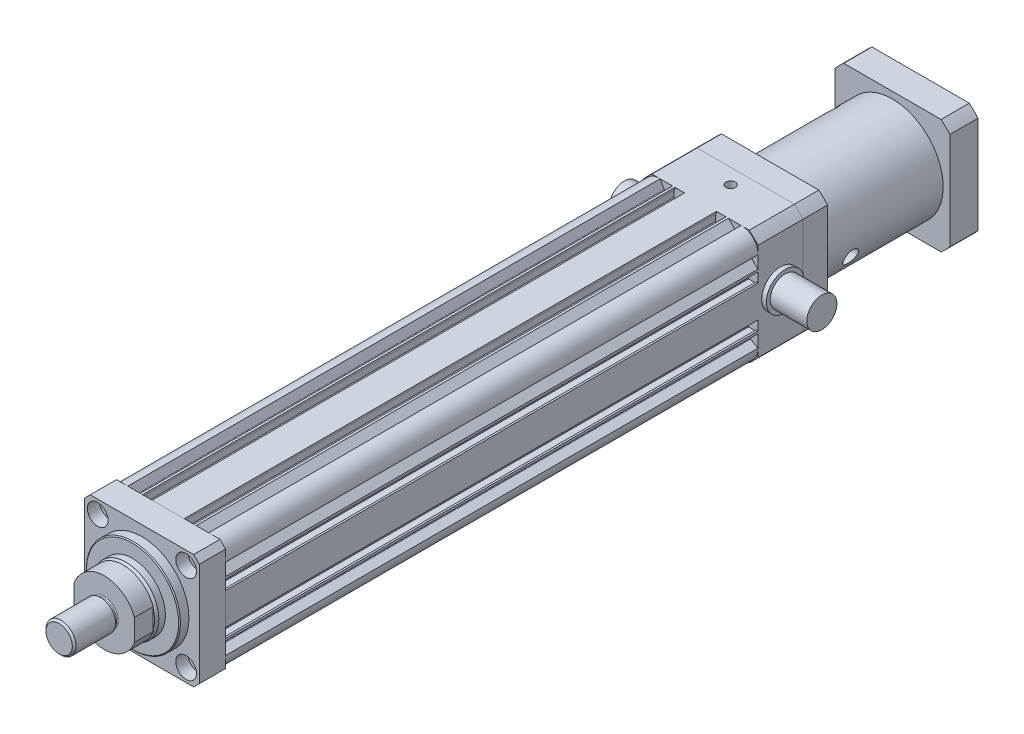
from build123d import *

# Parameters (mm, degrees)
SKETCH_1_R           = 25
SKETCH_1_R_2         = 2.594
EXTRUDE_1_DEPTH      = 283
EXTRUDE_1_2_DEPTH    = 14
SKETCH_3_R           = 4.5
SKETCH_3_R_2         = 3.5
CUT_EXTRUDE_3_DEPTH  = 14
SKETCH_3_5_R         = 5.5
CUT_EXTRUDE_4_DEPTH  = 6.5
SKETCH_5_R           = 25
EXTRUDE_2_DEPTH      = 5
CHAMFER_1_SIZE       = 0.5
SKETCH_6_R           = 17.5
EXTRUDE_3_DEPTH      = 5
CHAMFER_2_SIZE       = 1.5
CHAMFER_2_SIZE2      = 0.8
EXTRUDE_4_DEPTH      = 10
SKETCH_8_R           = 7
EXTRUDE_5_DEPTH      = 2
SKETCH_9_R           = 8
EXTRUDE_6_DEPTH      = 22
CHAMFER_3_SIZE       = 1
FILLET_1_R           = 0.5
SKETCH_10_W          = 61
SKETCH_10_H          = 61
EXTRUDE_7_DEPTH      = 24
SKETCH_11_R          = 50
SKETCH_11_R_2        = 40
CUT_EXTRUDE_1_DEPTH  = 24
SKETCH_16_W          = 61
SKETCH_16_H          = 61
EXTRUDE_8_DEPTH      = 13
SKETCH_18_R          = 3.5
CUT_EXTRUDE_5_DEPTH  = 13
SKETCH_19_R          = 27
EXTRUDE_9_DEPTH      = 65
SKETCH_20_W          = 61
SKETCH_20_H          = 61
EXTRUDE_10_DEPTH     = 15
SKETCH_21_R          = 2.5
CUT_EXTRUDE_6_DEPTH  = 10
SKETCH_22_R          = 50
SKETCH_22_R_2        = 40
CUT_EXTRUDE_2_DEPTH  = 93
SKETCH_23_R          = 21
CUT_EXTRUDE_7_DEPTH  = 80
SKETCH_23_3_R        = 25
CUT_EXTRUDE_8_DEPTH  = 7
SKETCH_24_R          = 4
CUT_EXTRUDE_9_DEPTH  = 27
SKETCH_25_R          = 4
CUT_EXTRUDE_10_DEPTH = 27
SKETCH_26_R          = 8
EXTRUDE_11_DEPTH     = 22
EXTRUDE_START        = -83
SKETCH_26_2_R        = 8
EXTRUDE_12_DEPTH     = 22
SKETCH_27_R          = 10
SKETCH_27_R_2        = 8
EXTRUDE_13_DEPTH     = 2.5
EXTRUDE_START_2      = -63.5
SKETCH_27_2_R        = 10
SKETCH_27_2_R_2      = 8
EXTRUDE_14_DEPTH     = 2.5


with BuildPart() as part:
    # Sketch 1 → Extrude 1 (new body)
    with BuildSketch(Plane.XY):
        with BuildLine():
            Line((30.5, 8.5), (29.5, 8.5))
            Line((29.5, 8.5), (29.5, 7.9))
            Line((29.5, 7.9), (25.5, 7.9))
            Line((25.5, 7.9), (25.5, 14.2))
            Line((25.5, 14.2), (29.5, 14.2))
            Line((29.5, 14.2), (29.5, 13.6))
            Line((29.5, 13.6), (30.5, 13.6))
            Line((30.5, 13.6), (30.5, 14.843551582))
            Line((30.5, 14.843551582), (26.602512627, 18.741038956))
            ThreePointArc((26.602512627, 18.741038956), (26.502994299, 19.034210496), (26.675, 19.29163522))
            Line((26.675, 19.29163522), (30.5, 21.5))
            ThreePointArc((30.5, 21.5), (28.010599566, 28.010599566), (21.5, 30.5))
            Line((21.5, 30.5), (19.29163522, 26.675))
            ThreePointArc((19.29163522, 26.675), (19.034210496, 26.502994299), (18.741038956, 26.602512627))
            Line((18.741038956, 26.602512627), (14.843551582, 30.5))
            Line((14.843551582, 30.5), (13.6, 30.5))
            Line((13.6, 30.5), (13.6, 29.5))
            Line((13.6, 29.5), (14.2, 29.5))
            Line((14.2, 29.5), (14.2, 25.5))
            Line((14.2, 25.5), (7.9, 25.5))
            Line((7.9, 25.5), (7.9, 29.5))
            Line((7.9, 29.5), (8.5, 29.5))
            Line((8.5, 29.5), (8.5, 30.5))
            Line((8.5, 30.5), (-8.5, 30.5))
            Line((-8.5, 30.5), (-8.5, 29.5))
            Line((-8.5, 29.5), (-7.9, 29.5))
            Line((-7.9, 29.5), (-7.9, 25.5))
            Line((-7.9, 25.5), (-14.2, 25.5))
            Line((-14.2, 25.5), (-14.2, 29.5))
            Line((-14.2, 29.5), (-13.6, 29.5))
            Line((-13.6, 29.5), (-13.6, 30.5))
            Line((-13.6, 30.5), (-14.843551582, 30.5))
            Line((-14.843551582, 30.5), (-18.741038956, 26.602512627))
            ThreePointArc((-18.741038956, 26.602512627), (-19.034210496, 26.502994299), (-19.29163522, 26.675))
            Line((-19.29163522, 26.675), (-21.5, 30.5))
            ThreePointArc((-21.5, 30.5), (-28.010599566, 28.010599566), (-30.5, 21.5))
            Line((-30.5, 21.5), (-26.675, 19.29163522))
            ThreePointArc((-26.675, 19.29163522), (-26.502994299, 19.034210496), (-26.602512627, 18.741038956))
            Line((-26.602512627, 18.741038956), (-30.5, 14.843551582))
            Line((-30.5, 14.843551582), (-30.5, 13.6))
            Line((-30.5, 13.6), (-29.5, 13.6))
            Line((-29.5, 13.6), (-29.5, 14.2))
            Line((-29.5, 14.2), (-25.5, 14.2))
            Line((-25.5, 14.2), (-25.5, 7.9))
            Line((-25.5, 7.9), (-29.5, 7.9))
            Line((-29.5, 7.9), (-29.5, 8.5))
            Line((-29.5, 8.5), (-30.5, 8.5))
            Line((-30.5, 8.5), (-30.5, -8.5))
            Line((-30.5, -8.5), (-29.5, -8.5))
            Line((-29.5, -8.5), (-29.5, -7.9))
            Line((-29.5, -7.9), (-25.5, -7.9))
            Line((-25.5, -7.9), (-25.5, -14.2))
            Line((-25.5, -14.2), (-29.5, -14.2))
            Line((-29.5, -14.2), (-29.5, -13.6))
            Line((-29.5, -13.6), (-30.5, -13.6))
            Line((-30.5, -13.6), (-30.5, -14.843551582))
            Line((-30.5, -14.843551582), (-26.602512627, -18.741038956))
            ThreePointArc((-26.602512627, -18.741038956), (-26.502994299, -19.034210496), (-26.675, -19.29163522))
            Line((-26.675, -19.29163522), (-30.5, -21.5))
            ThreePointArc((-30.5, -21.5), (-27.825897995, -28.191225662), (-21, -30.5))
            Line((-21, -30.5), (-18.79163522, -26.675))
            ThreePointArc((-18.79163522, -26.675), (-18.534210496, -26.502994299), (-18.241038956, -26.602512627))
            Line((-18.241038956, -26.602512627), (-14.343551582, -30.5))
            Line((-14.343551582, -30.5), (14.343551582, -30.5))
            Line((14.343551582, -30.5), (18.241038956, -26.602512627))
            ThreePointArc((18.241038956, -26.602512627), (18.534210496, -26.502994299), (18.79163522, -26.675))
            Line((18.79163522, -26.675), (21, -30.5))
            ThreePointArc((21, -30.5), (27.825897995, -28.191225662), (30.5, -21.5))
            Line((30.5, -21.5), (26.675, -19.29163522))
            ThreePointArc((26.675, -19.29163522), (26.502994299, -19.034210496), (26.602512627, -18.741038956))
            Line((26.602512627, -18.741038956), (30.5, -14.843551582))
            Line((30.5, -14.843551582), (30.5, -13.6))
            Line((30.5, -13.6), (29.5, -13.6))
            Line((29.5, -13.6), (29.5, -14.2))
            Line((29.5, -14.2), (25.5, -14.2))
            Line((25.5, -14.2), (25.5, -7.9))
            Line((25.5, -7.9), (29.5, -7.9))
            Line((29.5, -7.9), (29.5, -8.5))
            Line((29.5, -8.5), (30.5, -8.5))
            Line((30.5, -8.5), (30.5, 8.5))
        make_face()
        Circle(SKETCH_1_R, mode=Mode.SUBTRACT)
        with Locations((23.5, -23.5)):
            Circle(SKETCH_1_R_2, mode=Mode.SUBTRACT)
        with Locations((-23.5, -23.5)):
            Circle(SKETCH_1_R_2, mode=Mode.SUBTRACT)
        with Locations((23.5, 23.5)):
            Circle(SKETCH_1_R_2, mode=Mode.SUBTRACT)
        with Locations((-23.5, 23.5)):
            Circle(SKETCH_1_R_2, mode=Mode.SUBTRACT)
        with BuildLine():
            Line((-14.843484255, -26.551505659), (-5.699422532, -26.551505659))
            ThreePointArc((-5.699422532, -26.551505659), (-5.401016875, -26.282393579), (-5.637974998, -25.957866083))
            ThreePointArc((-5.637974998, -25.957866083), (-10.496775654, -24.470016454), (-15.006657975, -22.128520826))
            ThreePointArc((-15.006657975, -22.128520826), (-15.31244973, -22.117932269), (-15.468484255, -22.381131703))
            Line((-15.468484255, -22.381131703), (-15.468484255, -25.926505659))
            Line((-15.468484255, -25.926505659), (-14.843484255, -26.551505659))
        make_face(mode=Mode.SUBTRACT)
        with BuildLine():
            Line((15.037740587, -26.551505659), (5.893678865, -26.551505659))
            ThreePointArc((5.893678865, -26.551505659), (5.595273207, -26.282393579), (5.832231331, -25.957866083))
            ThreePointArc((5.832231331, -25.957866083), (10.691031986, -24.470016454), (15.200914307, -22.128520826))
            ThreePointArc((15.200914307, -22.128520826), (15.506706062, -22.117932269), (15.662740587, -22.381131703))
            Line((15.662740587, -22.381131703), (15.662740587, -25.926505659))
            Line((15.662740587, -25.926505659), (15.037740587, -26.551505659))
        make_face(mode=Mode.SUBTRACT)
        with BuildLine():
            Line((24.057261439, -13.884764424), (23.358946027, -13.481591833))
            ThreePointArc((23.358946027, -13.481591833), (23.055418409, -13.441631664), (22.812535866, -13.628001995))
            Line((22.812535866, -13.628001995), (21.480305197, -15.935493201))
            ThreePointArc((21.480305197, -15.935493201), (21.440345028, -16.239020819), (21.626715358, -16.481903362))
            Line((21.626715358, -16.481903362), (22.892186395, -17.212523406))
            ThreePointArc((22.892186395, -17.212523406), (23.195714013, -17.252483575), (23.438596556, -17.066113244))
            Line((23.438596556, -17.066113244), (24.274264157, -15.618694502))
            ThreePointArc((24.274264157, -15.618694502), (24.317966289, -15.507082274), (24.326638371, -15.387533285))
            Line((24.326638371, -15.387533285), (24.223757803, -14.070923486))
            ThreePointArc((24.223757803, -14.070923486), (24.155411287, -13.964516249), (24.057261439, -13.884764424))
        make_face(mode=Mode.SUBTRACT)
        with BuildLine():
            Line((-24.057261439, -13.884764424), (-23.358946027, -13.481591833))
            ThreePointArc((-23.358946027, -13.481591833), (-23.055418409, -13.441631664), (-22.812535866, -13.628001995))
            Line((-22.812535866, -13.628001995), (-21.480305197, -15.935493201))
            ThreePointArc((-21.480305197, -15.935493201), (-21.440345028, -16.239020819), (-21.626715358, -16.481903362))
            Line((-21.626715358, -16.481903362), (-22.892186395, -17.212523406))
            ThreePointArc((-22.892186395, -17.212523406), (-23.195714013, -17.252483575), (-23.438596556, -17.066113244))
            Line((-23.438596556, -17.066113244), (-24.274264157, -15.618694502))
            ThreePointArc((-24.274264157, -15.618694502), (-24.317966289, -15.507082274), (-24.326638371, -15.387533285))
            Line((-24.326638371, -15.387533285), (-24.223757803, -14.070923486))
            ThreePointArc((-24.223757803, -14.070923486), (-24.155411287, -13.964516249), (-24.057261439, -13.884764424))
        make_face(mode=Mode.SUBTRACT)
        with BuildLine():
            Line((24.057261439, 13.884764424), (23.358946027, 13.481591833))
            ThreePointArc((23.358946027, 13.481591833), (23.055418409, 13.441631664), (22.812535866, 13.628001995))
            Line((22.812535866, 13.628001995), (21.480305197, 15.935493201))
            ThreePointArc((21.480305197, 15.935493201), (21.440345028, 16.239020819), (21.626715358, 16.481903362))
            Line((21.626715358, 16.481903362), (22.892186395, 17.212523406))
            ThreePointArc((22.892186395, 17.212523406), (23.195714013, 17.252483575), (23.438596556, 17.066113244))
            Line((23.438596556, 17.066113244), (24.274264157, 15.618694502))
            ThreePointArc((24.274264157, 15.618694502), (24.317966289, 15.507082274), (24.326638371, 15.387533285))
            Line((24.326638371, 15.387533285), (24.223757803, 14.070923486))
            ThreePointArc((24.223757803, 14.070923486), (24.155411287, 13.964516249), (24.057261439, 13.884764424))
        make_face(mode=Mode.SUBTRACT)
        with BuildLine():
            Line((-24.057261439, 13.884764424), (-23.358946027, 13.481591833))
            ThreePointArc((-23.358946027, 13.481591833), (-23.055418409, 13.441631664), (-22.812535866, 13.628001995))
            Line((-22.812535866, 13.628001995), (-21.480305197, 15.935493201))
            ThreePointArc((-21.480305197, 15.935493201), (-21.440345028, 16.239020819), (-21.626715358, 16.481903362))
            Line((-21.626715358, 16.481903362), (-22.892186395, 17.212523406))
            ThreePointArc((-22.892186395, 17.212523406), (-23.195714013, 17.252483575), (-23.438596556, 17.066113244))
            Line((-23.438596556, 17.066113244), (-24.274264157, 15.618694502))
            ThreePointArc((-24.274264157, 15.618694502), (-24.317966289, 15.507082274), (-24.326638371, 15.387533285))
            Line((-24.326638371, 15.387533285), (-24.223757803, 14.070923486))
            ThreePointArc((-24.223757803, 14.070923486), (-24.155411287, 13.964516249), (-24.057261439, 13.884764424))
        make_face(mode=Mode.SUBTRACT)
        with BuildLine():
            Line((17.761634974, 23.75411276), (17.07315308, 24.68624059))
            ThreePointArc((17.07315308, 24.68624059), (16.934629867, 24.812286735), (16.758415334, 24.87572765))
            Line((16.758415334, 24.87572765), (13.966108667, 25.295529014))
            ThreePointArc((13.966108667, 25.295529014), (13.689318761, 25.25468305), (13.482325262, 25.066441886))
            Line((13.482325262, 25.066441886), (12.839111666, 23.986237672))
            ThreePointArc((12.839111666, 23.986237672), (12.785382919, 23.626185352), (12.999780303, 23.331977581))
            ThreePointArc((12.999780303, 23.331977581), (14.833000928, 22.112125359), (16.576342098, 20.766949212))
            ThreePointArc((16.576342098, 20.766949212), (17.053890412, 20.688035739), (17.357364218, 21.065107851))
            Line((17.357364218, 21.065107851), (17.761634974, 23.75411276))
        make_face(mode=Mode.SUBTRACT)
        with BuildLine():
            Line((-17.761634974, 23.75411276), (-17.07315308, 24.68624059))
            ThreePointArc((-17.07315308, 24.68624059), (-16.934629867, 24.812286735), (-16.758415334, 24.87572765))
            Line((-16.758415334, 24.87572765), (-13.966108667, 25.295529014))
            ThreePointArc((-13.966108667, 25.295529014), (-13.689318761, 25.25468305), (-13.482325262, 25.066441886))
            Line((-13.482325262, 25.066441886), (-12.839111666, 23.986237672))
            ThreePointArc((-12.839111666, 23.986237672), (-12.785382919, 23.626185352), (-12.999780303, 23.331977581))
            ThreePointArc((-12.999780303, 23.331977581), (-14.833000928, 22.112125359), (-16.576342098, 20.766949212))
            ThreePointArc((-16.576342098, 20.766949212), (-17.053890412, 20.688035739), (-17.357364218, 21.065107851))
            Line((-17.357364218, 21.065107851), (-17.761634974, 23.75411276))
        make_face(mode=Mode.SUBTRACT)
    extrude(amount=EXTRUDE_1_DEPTH)

    # Sketch 10 → Extrude 7 (add)
    with BuildSketch(Plane(origin=(0, 0, 0), x_dir=(-1, 0, 0), z_dir=(0, 0, -1))):
        Rectangle(SKETCH_10_W, SKETCH_10_H)
    extrude(amount=EXTRUDE_7_DEPTH)

    # Sketch 11 → Cut-Extrude 1 (cut)
    with BuildSketch(Plane(origin=(0, 0, -24), x_dir=(-1, 0, 0), z_dir=(0, 0, -1))):
        Circle(SKETCH_11_R)
        Circle(SKETCH_11_R_2, mode=Mode.SUBTRACT)
    extrude(amount=-CUT_EXTRUDE_1_DEPTH, mode=Mode.SUBTRACT)

    # Sketch 15 → Hole Wizard M6 _1 (revolve, cut)
    with BuildSketch(Plane(origin=(0, 30.5, -16), x_dir=(0, 0, 1), z_dir=(1, 0, 0))):
        Polygon((0, 0), (0, 9.502151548), (2.5, 8), (2.5, 0), align=None)
    revolve(axis=Axis((0, 36.85, -16), (0, -1, 0)), mode=Mode.SUBTRACT)

    # Sketch 26 → Extrude 11 (add)
    with BuildSketch(Plane.ZY.offset(30.5)):
        with Locations((-12, 0)):
            Circle(SKETCH_26_R)
    extrude(amount=EXTRUDE_11_DEPTH)

    # Sketch 26_2 → Extrude 12 (add)
    with BuildSketch(Plane.ZY.offset(30.5).offset(EXTRUDE_START)):
        with Locations((-12, 0)):
            Circle(SKETCH_26_2_R)
    extrude(amount=EXTRUDE_12_DEPTH)

    # Sketch 27 → Extrude 13 (add)
    with BuildSketch(Plane.ZY.offset(30.5)):
        with Locations((-12, 0)):
            Circle(SKETCH_27_R)
        with Locations((-12, 0)):
            Circle(SKETCH_27_R_2, mode=Mode.SUBTRACT)
    extrude(amount=EXTRUDE_13_DEPTH)

    # Sketch 27_2 → Extrude 14 (add)
    with BuildSketch(Plane.ZY.offset(30.5).offset(EXTRUDE_START_2)):
        with Locations((-12, 0)):
            Circle(SKETCH_27_2_R)
        with Locations((-12, 0)):
            Circle(SKETCH_27_2_R_2, mode=Mode.SUBTRACT)
    extrude(amount=EXTRUDE_14_DEPTH)


with BuildPart() as body_2:
    # Sketch 2 → Extrude 1 2 (new body)
    with BuildSketch(Plane.XY.offset(283)):
        Polygon((-27.5, 30.5), (-30.5, 27.5), (-30.5, -27.5), (-27.5, -30.5), (27.5, -30.5), (30.5, -27.5), (30.5, 27.5), (27.5, 30.5), align=None)
    extrude(amount=EXTRUDE_1_2_DEPTH)

    # Sketch 3 → Cut-Extrude 3 (cut)
    with BuildSketch(Plane.XY.offset(297)):
        with Locations((-40, -20)):
            Circle(SKETCH_3_R)
        with Locations((-23.5, -23.5)):
            Circle(SKETCH_3_R_2)
        with Locations((-23.5, 23.5)):
            Circle(SKETCH_3_R_2)
        with Locations((23.5, 23.5)):
            Circle(SKETCH_3_R_2)
        with Locations((40, 20)):
            Circle(SKETCH_3_R)
        with Locations((40, -20)):
            Circle(SKETCH_3_R)
        with Locations((23.5, -23.5)):
            Circle(SKETCH_3_R_2)
        with Locations((-40, 20)):
            Circle(SKETCH_3_R)
    extrude(amount=-CUT_EXTRUDE_3_DEPTH, mode=Mode.SUBTRACT)

    # Sketch 3_5 → Cut-Extrude 4 (cut)
    with BuildSketch(Plane.XY.offset(297)):
        with Locations((-23.5, 23.5)):
            Circle(SKETCH_3_5_R)
        with Locations((-23.5, -23.5)):
            Circle(SKETCH_3_5_R)
        with Locations((23.5, -23.5)):
            Circle(SKETCH_3_5_R)
        with Locations((23.5, 23.5)):
            Circle(SKETCH_3_5_R)
    extrude(amount=-CUT_EXTRUDE_4_DEPTH, mode=Mode.SUBTRACT)

    # Sketch 5 → Extrude 2 (add)
    with BuildSketch(Plane.XY.offset(297)):
        Circle(SKETCH_5_R)
    extrude(amount=EXTRUDE_2_DEPTH)

    # Chamfer 1
    chamfer_1_edges = [body_2.edges().sort_by_distance(p)[0] for p in [
        (-25, 0, 302),
    ]]
    chamfer(chamfer_1_edges, length=CHAMFER_1_SIZE)

    # Sketch 6 → Extrude 3 (add)
    with BuildSketch(Plane.XY.offset(302)):
        Circle(SKETCH_6_R)
    extrude(amount=EXTRUDE_3_DEPTH)

    # Chamfer 2
    chamfer_2_edges = [body_2.edges().sort_by_distance(p)[0] for p in [
        (-17.5, 0, 307),
    ]]
    chamfer_2_side = [body_2.faces().sort_by_distance(p)[0] for p in [
        (-17.5, 0, 304.5),
    ]]
    chamfer(chamfer_2_edges, length=CHAMFER_2_SIZE, length2=CHAMFER_2_SIZE2, reference=chamfer_2_side[0])

    # Sketch 7 → Extrude 4 (add)
    with BuildSketch(Plane.XY.offset(307)):
        with BuildLine():
            Line((-16, 5.744562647), (-16, -5.744562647))
            ThreePointArc((-16, -5.744562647), (0, -17), (16, -5.744562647))
            Line((16, -5.744562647), (16, 5.744562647))
            ThreePointArc((16, 5.744562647), (0, 17), (-16, 5.744562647))
        make_face()
    extrude(amount=EXTRUDE_4_DEPTH)

    # Sketch 8 → Extrude 5 (add)
    with BuildSketch(Plane.XY.offset(317)):
        Circle(SKETCH_8_R)
    extrude(amount=EXTRUDE_5_DEPTH)

    # Sketch 9 → Extrude 6 (add)
    with BuildSketch(Plane.XY.offset(319)):
        Circle(SKETCH_9_R)
    extrude(amount=EXTRUDE_6_DEPTH)

    # Chamfer 3
    chamfer_3_edges = [body_2.edges().sort_by_distance(p)[0] for p in [
        (-8, 0, 341),
    ]]
    chamfer(chamfer_3_edges, length=CHAMFER_3_SIZE)

    # Fillet 1
    fillet_1_edges = [body_2.edges().sort_by_distance(p)[0] for p in [
        (-7, 0, 317),
    ]]
    fillet(fillet_1_edges, radius=FILLET_1_R)


with BuildPart() as body_3:
    # Sketch 16 → Extrude 8 (new body)
    with BuildSketch(Plane(origin=(0, 0, -24), x_dir=(-1, 0, 0), z_dir=(0, 0, -1))):
        Rectangle(SKETCH_16_W, SKETCH_16_H)
    extrude(amount=EXTRUDE_8_DEPTH)

    # Sketch 18 → Cut-Extrude 5 (cut)
    with BuildSketch(Plane(origin=(0, 0, -37), x_dir=(-1, 0, 0), z_dir=(0, 0, -1))):
        with Locations((-23.5, 23.5)):
            Circle(SKETCH_18_R)
        with Locations((-23.5, -23.5)):
            Circle(SKETCH_18_R)
        with Locations((23.5, -23.5)):
            Circle(SKETCH_18_R)
        with Locations((23.5, 23.5)):
            Circle(SKETCH_18_R)
    extrude(amount=-CUT_EXTRUDE_5_DEPTH, mode=Mode.SUBTRACT)

    # Sketch 19 → Extrude 9 (add)
    with BuildSketch(Plane(origin=(0, 0, -37), x_dir=(-1, 0, 0), z_dir=(0, 0, -1))):
        Circle(SKETCH_19_R)
    extrude(amount=EXTRUDE_9_DEPTH)

    # Sketch 20 → Extrude 10 (add)
    with BuildSketch(Plane(origin=(0, 0, -102), x_dir=(-1, 0, 0), z_dir=(0, 0, -1))):
        Rectangle(SKETCH_20_W, SKETCH_20_H)
    extrude(amount=EXTRUDE_10_DEPTH)

    # Sketch 21 → Cut-Extrude 6 (cut)
    with BuildSketch(Plane(origin=(0, 0, -117), x_dir=(-1, 0, 0), z_dir=(0, 0, -1))):
        with Locations((-24.748737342, 24.748737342)):
            Circle(SKETCH_21_R)
        with Locations((24.748737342, 24.748737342)):
            Circle(SKETCH_21_R)
        with Locations((24.748737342, -24.748737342)):
            Circle(SKETCH_21_R)
        with Locations((-24.748737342, -24.748737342)):
            Circle(SKETCH_21_R)
    extrude(amount=-CUT_EXTRUDE_6_DEPTH, mode=Mode.SUBTRACT)

    # Sketch 22 → Cut-Extrude 2 (cut)
    with BuildSketch(Plane(origin=(0, 0, -117), x_dir=(-1, 0, 0), z_dir=(0, 0, -1))):
        Circle(SKETCH_22_R)
        Circle(SKETCH_22_R_2, mode=Mode.SUBTRACT)
    extrude(amount=-CUT_EXTRUDE_2_DEPTH, mode=Mode.SUBTRACT)

    # Sketch 23 → Cut-Extrude 7 (cut)
    with BuildSketch(Plane(origin=(0, 0, -117), x_dir=(-1, 0, 0), z_dir=(0, 0, -1))):
        Circle(SKETCH_23_R)
    extrude(amount=-CUT_EXTRUDE_7_DEPTH, mode=Mode.SUBTRACT)

    # Sketch 23_3 → Cut-Extrude 8 (cut)
    with BuildSketch(Plane(origin=(0, 0, -117), x_dir=(-1, 0, 0), z_dir=(0, 0, -1))):
        Circle(SKETCH_23_3_R)
    extrude(amount=-CUT_EXTRUDE_8_DEPTH, mode=Mode.SUBTRACT)

    # Sketch 24 → Cut-Extrude 9 (cut)
    with BuildSketch(Plane.ZY.offset(30.5)):
        with Locations(Location((-88.78323725, 17.446251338, 0), (0, 0, 270))):
            Circle(SKETCH_24_R)
    extrude(amount=-CUT_EXTRUDE_9_DEPTH, mode=Mode.SUBTRACT)

    # Sketch 25 → Cut-Extrude 10 (cut)
    with BuildSketch(Plane(origin=(30.5, 0, 0), x_dir=(0, 0, -1), z_dir=(1, 0, 0))):
        with Locations((54.542092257, -9.414024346)):
            Circle(SKETCH_25_R)
    extrude(amount=-CUT_EXTRUDE_10_DEPTH, mode=Mode.SUBTRACT)


solid = Compound([part.part, body_2.part, body_3.part])
